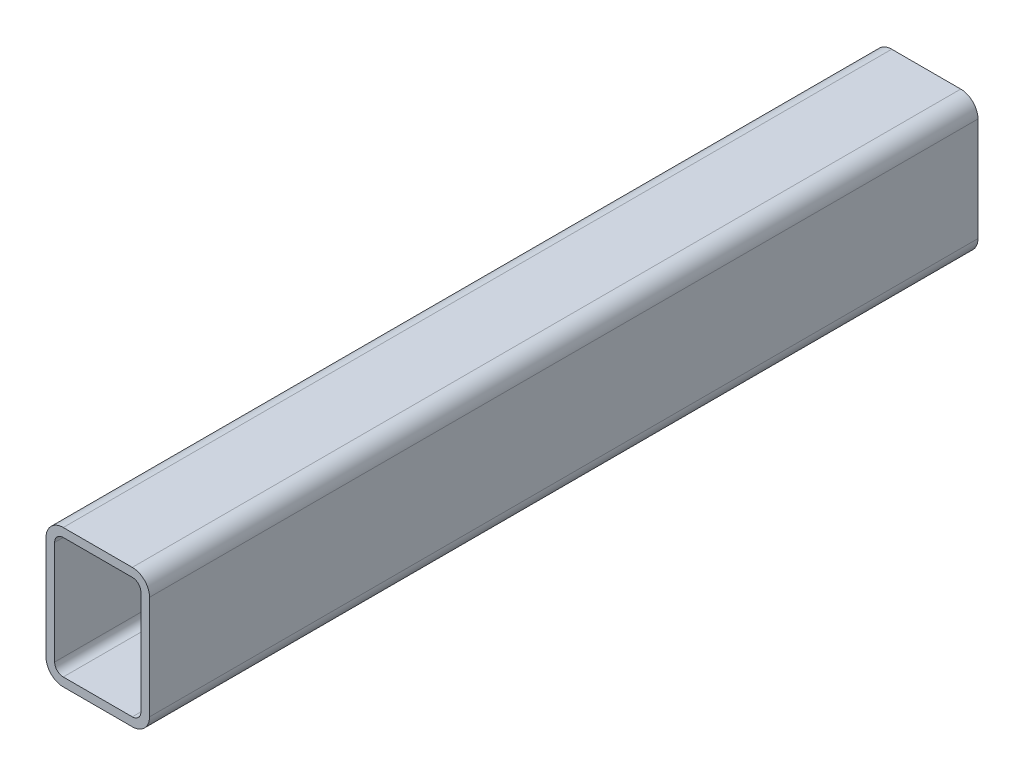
ISO-10303-21;
HEADER;
FILE_DESCRIPTION(('STEP AP214'),'2;1');
FILE_NAME('part.step','',(''),(''),'','','');
FILE_SCHEMA(('AUTOMOTIVE_DESIGN { 1 0 10303 214 1 1 1 1 }'));
ENDSEC;
DATA;
#1=APPLICATION_CONTEXT('core data for automotive mechanical design processes');
#2=APPLICATION_PROTOCOL_DEFINITION('international standard','automotive_design',2000,#1);
#3=PRODUCT_CONTEXT('',#1,'mechanical');
#4=PRODUCT('Part','Part','',(#3));
#5=PRODUCT_RELATED_PRODUCT_CATEGORY('part','',(#4));
#6=PRODUCT_DEFINITION_FORMATION('','',#4);
#7=PRODUCT_DEFINITION_CONTEXT('part definition',#1,'design');
#8=PRODUCT_DEFINITION('design','',#6,#7);
#9=PRODUCT_DEFINITION_SHAPE('','',#8);
#10=(LENGTH_UNIT() NAMED_UNIT(*) SI_UNIT(.MILLI.,.METRE.));
#11=(NAMED_UNIT(*) PLANE_ANGLE_UNIT() SI_UNIT($,.RADIAN.));
#12=(NAMED_UNIT(*) SI_UNIT($,.STERADIAN.) SOLID_ANGLE_UNIT());
#13=UNCERTAINTY_MEASURE_WITH_UNIT(LENGTH_MEASURE(1.E-05),#10,'distance_accuracy_value','');
#14=(GEOMETRIC_REPRESENTATION_CONTEXT(3) GLOBAL_UNCERTAINTY_ASSIGNED_CONTEXT((#13)) GLOBAL_UNIT_ASSIGNED_CONTEXT((#10,
#11,#12)) REPRESENTATION_CONTEXT('',''));
#15=CARTESIAN_POINT('',(0.,0.,0.));
#16=DIRECTION('',(0.,0.,1.));
#17=DIRECTION('',(1.,0.,0.));
#18=AXIS2_PLACEMENT_3D('',#15,#16,#17);
#19=CARTESIAN_POINT('',(6.35,44.45,304.8));
#20=DIRECTION('',(0.,0.,1.));
#21=DIRECTION('',(1.,0.,0.));
#22=AXIS2_PLACEMENT_3D('',#19,#20,#21);
#23=PLANE('',#22);
#24=CARTESIAN_POINT('',(6.35,44.45,304.8));
#25=DIRECTION('',(0.,0.,1.));
#26=DIRECTION('',(1.,0.,0.));
#27=AXIS2_PLACEMENT_3D('',#24,#25,#26);
#28=CIRCLE('',#27,6.35);
#29=CARTESIAN_POINT('',(6.35,50.8,304.8));
#30=VERTEX_POINT('',#29);
#31=CARTESIAN_POINT('',(0.,44.45,304.8));
#32=VERTEX_POINT('',#31);
#33=EDGE_CURVE('E211',#30,#32,#28,.T.);
#34=ORIENTED_EDGE('',*,*,#33,.T.);
#35=DIRECTION('',(0.,-1.,0.));
#36=VECTOR('',#35,1.);
#37=CARTESIAN_POINT('',(0.,6.35,304.8));
#38=LINE('',#37,#36);
#39=CARTESIAN_POINT('',(0.,6.35,304.8));
#40=VERTEX_POINT('',#39);
#41=EDGE_CURVE('E214',#32,#40,#38,.T.);
#42=ORIENTED_EDGE('',*,*,#41,.T.);
#43=CARTESIAN_POINT('',(6.35,6.35,304.8));
#44=DIRECTION('',(0.,0.,1.));
#45=DIRECTION('',(1.,0.,0.));
#46=AXIS2_PLACEMENT_3D('',#43,#44,#45);
#47=CIRCLE('',#46,6.35);
#48=CARTESIAN_POINT('',(6.35,0.,304.8));
#49=VERTEX_POINT('',#48);
#50=EDGE_CURVE('E217',#40,#49,#47,.T.);
#51=ORIENTED_EDGE('',*,*,#50,.T.);
#52=DIRECTION('',(1.,0.,0.));
#53=VECTOR('',#52,1.);
#54=CARTESIAN_POINT('',(31.75,0.,304.8));
#55=LINE('',#54,#53);
#56=CARTESIAN_POINT('',(31.75,0.,304.8));
#57=VERTEX_POINT('',#56);
#58=EDGE_CURVE('E219',#49,#57,#55,.T.);
#59=ORIENTED_EDGE('',*,*,#58,.T.);
#60=CARTESIAN_POINT('',(31.75,6.35,304.8));
#61=DIRECTION('',(0.,0.,1.));
#62=DIRECTION('',(1.,0.,0.));
#63=AXIS2_PLACEMENT_3D('',#60,#61,#62);
#64=CIRCLE('',#63,6.35);
#65=CARTESIAN_POINT('',(38.1,6.35,304.8));
#66=VERTEX_POINT('',#65);
#67=EDGE_CURVE('E221',#57,#66,#64,.T.);
#68=ORIENTED_EDGE('',*,*,#67,.T.);
#69=DIRECTION('',(0.,1.,0.));
#70=VECTOR('',#69,1.);
#71=CARTESIAN_POINT('',(38.1,44.45,304.8));
#72=LINE('',#71,#70);
#73=CARTESIAN_POINT('',(38.1,44.45,304.8));
#74=VERTEX_POINT('',#73);
#75=EDGE_CURVE('E223',#66,#74,#72,.T.);
#76=ORIENTED_EDGE('',*,*,#75,.T.);
#77=CARTESIAN_POINT('',(31.75,44.45,304.8));
#78=DIRECTION('',(0.,0.,1.));
#79=DIRECTION('',(1.,0.,0.));
#80=AXIS2_PLACEMENT_3D('',#77,#78,#79);
#81=CIRCLE('',#80,6.35000000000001);
#82=CARTESIAN_POINT('',(31.75,50.8,304.8));
#83=VERTEX_POINT('',#82);
#84=EDGE_CURVE('E225',#74,#83,#81,.T.);
#85=ORIENTED_EDGE('',*,*,#84,.T.);
#86=DIRECTION('',(-1.,0.,0.));
#87=VECTOR('',#86,1.);
#88=CARTESIAN_POINT('',(6.35,50.8,304.8));
#89=LINE('',#88,#87);
#90=EDGE_CURVE('E227',#83,#30,#89,.T.);
#91=ORIENTED_EDGE('',*,*,#90,.T.);
#92=EDGE_LOOP('',(#34,#42,#51,#59,#68,#76,#85,#91));
#93=FACE_BOUND('',#92,.T.);
#94=DIRECTION('',(0.,-1.,0.));
#95=VECTOR('',#94,1.);
#96=CARTESIAN_POINT('',(3.175,6.35,304.8));
#97=LINE('',#96,#95);
#98=CARTESIAN_POINT('',(3.175,44.45,304.8));
#99=VERTEX_POINT('',#98);
#100=CARTESIAN_POINT('',(3.175,6.35,304.8));
#101=VERTEX_POINT('',#100);
#102=EDGE_CURVE('E154',#99,#101,#97,.T.);
#103=ORIENTED_EDGE('',*,*,#102,.F.);
#104=CARTESIAN_POINT('',(6.35,44.45,304.8));
#105=DIRECTION('',(0.,0.,1.));
#106=DIRECTION('',(1.,0.,0.));
#107=AXIS2_PLACEMENT_3D('',#104,#105,#106);
#108=CIRCLE('',#107,3.175);
#109=CARTESIAN_POINT('',(6.35,47.625,304.8));
#110=VERTEX_POINT('',#109);
#111=EDGE_CURVE('E146',#110,#99,#108,.T.);
#112=ORIENTED_EDGE('',*,*,#111,.F.);
#113=DIRECTION('',(-1.,0.,0.));
#114=VECTOR('',#113,1.);
#115=CARTESIAN_POINT('',(6.35,47.625,304.8));
#116=LINE('',#115,#114);
#117=CARTESIAN_POINT('',(31.75,47.625,304.8));
#118=VERTEX_POINT('',#117);
#119=EDGE_CURVE('E179',#118,#110,#116,.T.);
#120=ORIENTED_EDGE('',*,*,#119,.F.);
#121=CARTESIAN_POINT('',(31.75,44.45,304.8));
#122=DIRECTION('',(0.,0.,1.));
#123=DIRECTION('',(1.,0.,0.));
#124=AXIS2_PLACEMENT_3D('',#121,#122,#123);
#125=CIRCLE('',#124,3.175);
#126=CARTESIAN_POINT('',(34.925,44.45,304.8));
#127=VERTEX_POINT('',#126);
#128=EDGE_CURVE('E177',#127,#118,#125,.T.);
#129=ORIENTED_EDGE('',*,*,#128,.F.);
#130=DIRECTION('',(0.,1.,0.));
#131=VECTOR('',#130,1.);
#132=CARTESIAN_POINT('',(34.925,44.45,304.8));
#133=LINE('',#132,#131);
#134=CARTESIAN_POINT('',(34.925,6.35,304.8));
#135=VERTEX_POINT('',#134);
#136=EDGE_CURVE('E175',#135,#127,#133,.T.);
#137=ORIENTED_EDGE('',*,*,#136,.F.);
#138=CARTESIAN_POINT('',(31.75,6.35,304.8));
#139=DIRECTION('',(0.,0.,1.));
#140=DIRECTION('',(1.,0.,0.));
#141=AXIS2_PLACEMENT_3D('',#138,#139,#140);
#142=CIRCLE('',#141,3.175);
#143=CARTESIAN_POINT('',(31.75,3.175,304.8));
#144=VERTEX_POINT('',#143);
#145=EDGE_CURVE('E173',#144,#135,#142,.T.);
#146=ORIENTED_EDGE('',*,*,#145,.F.);
#147=DIRECTION('',(1.,0.,0.));
#148=VECTOR('',#147,1.);
#149=CARTESIAN_POINT('',(31.75,3.175,304.8));
#150=LINE('',#149,#148);
#151=CARTESIAN_POINT('',(6.35,3.175,304.8));
#152=VERTEX_POINT('',#151);
#153=EDGE_CURVE('E169',#152,#144,#150,.T.);
#154=ORIENTED_EDGE('',*,*,#153,.F.);
#155=CARTESIAN_POINT('',(6.35,6.35,304.8));
#156=DIRECTION('',(0.,0.,1.));
#157=DIRECTION('',(1.,0.,0.));
#158=AXIS2_PLACEMENT_3D('',#155,#156,#157);
#159=CIRCLE('',#158,3.175);
#160=EDGE_CURVE('E167',#101,#152,#159,.T.);
#161=ORIENTED_EDGE('',*,*,#160,.F.);
#162=EDGE_LOOP('',(#103,#112,#120,#129,#137,#146,#154,#161));
#163=FACE_BOUND('',#162,.T.);
#164=ADVANCED_FACE('F33',(#93,#163),#23,.T.);
#165=CARTESIAN_POINT('',(6.35,44.45,0.));
#166=DIRECTION('',(0.,0.,1.));
#167=DIRECTION('',(1.,0.,0.));
#168=AXIS2_PLACEMENT_3D('',#165,#166,#167);
#169=PLANE('',#168);
#170=CARTESIAN_POINT('',(6.35,44.45,0.));
#171=DIRECTION('',(0.,0.,1.));
#172=DIRECTION('',(1.,0.,0.));
#173=AXIS2_PLACEMENT_3D('',#170,#171,#172);
#174=CIRCLE('',#173,6.35);
#175=CARTESIAN_POINT('',(6.35,50.8,0.));
#176=VERTEX_POINT('',#175);
#177=CARTESIAN_POINT('',(0.,44.45,0.));
#178=VERTEX_POINT('',#177);
#179=EDGE_CURVE('E162',#176,#178,#174,.T.);
#180=ORIENTED_EDGE('',*,*,#179,.F.);
#181=DIRECTION('',(-1.,0.,0.));
#182=VECTOR('',#181,1.);
#183=CARTESIAN_POINT('',(6.35,50.8,0.));
#184=LINE('',#183,#182);
#185=CARTESIAN_POINT('',(31.75,50.8,0.));
#186=VERTEX_POINT('',#185);
#187=EDGE_CURVE('E215',#186,#176,#184,.T.);
#188=ORIENTED_EDGE('',*,*,#187,.F.);
#189=CARTESIAN_POINT('',(31.75,44.45,0.));
#190=DIRECTION('',(0.,0.,1.));
#191=DIRECTION('',(1.,0.,0.));
#192=AXIS2_PLACEMENT_3D('',#189,#190,#191);
#193=CIRCLE('',#192,6.35000000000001);
#194=CARTESIAN_POINT('',(38.1,44.45,0.));
#195=VERTEX_POINT('',#194);
#196=EDGE_CURVE('E242',#195,#186,#193,.T.);
#197=ORIENTED_EDGE('',*,*,#196,.F.);
#198=DIRECTION('',(0.,1.,0.));
#199=VECTOR('',#198,1.);
#200=CARTESIAN_POINT('',(38.1,44.45,0.));
#201=LINE('',#200,#199);
#202=CARTESIAN_POINT('',(38.1,6.35,0.));
#203=VERTEX_POINT('',#202);
#204=EDGE_CURVE('E240',#203,#195,#201,.T.);
#205=ORIENTED_EDGE('',*,*,#204,.F.);
#206=CARTESIAN_POINT('',(31.75,6.35,0.));
#207=DIRECTION('',(0.,0.,1.));
#208=DIRECTION('',(1.,0.,0.));
#209=AXIS2_PLACEMENT_3D('',#206,#207,#208);
#210=CIRCLE('',#209,6.35);
#211=CARTESIAN_POINT('',(31.75,0.,0.));
#212=VERTEX_POINT('',#211);
#213=EDGE_CURVE('E238',#212,#203,#210,.T.);
#214=ORIENTED_EDGE('',*,*,#213,.F.);
#215=DIRECTION('',(1.,0.,0.));
#216=VECTOR('',#215,1.);
#217=CARTESIAN_POINT('',(31.75,0.,0.));
#218=LINE('',#217,#216);
#219=CARTESIAN_POINT('',(6.35,0.,0.));
#220=VERTEX_POINT('',#219);
#221=EDGE_CURVE('E236',#220,#212,#218,.T.);
#222=ORIENTED_EDGE('',*,*,#221,.F.);
#223=CARTESIAN_POINT('',(6.35,6.35,0.));
#224=DIRECTION('',(0.,0.,1.));
#225=DIRECTION('',(1.,0.,0.));
#226=AXIS2_PLACEMENT_3D('',#223,#224,#225);
#227=CIRCLE('',#226,6.35);
#228=CARTESIAN_POINT('',(0.,6.35,0.));
#229=VERTEX_POINT('',#228);
#230=EDGE_CURVE('E234',#229,#220,#227,.T.);
#231=ORIENTED_EDGE('',*,*,#230,.F.);
#232=DIRECTION('',(0.,-1.,0.));
#233=VECTOR('',#232,1.);
#234=CARTESIAN_POINT('',(0.,6.35,0.));
#235=LINE('',#234,#233);
#236=EDGE_CURVE('E232',#178,#229,#235,.T.);
#237=ORIENTED_EDGE('',*,*,#236,.F.);
#238=EDGE_LOOP('',(#180,#188,#197,#205,#214,#222,#231,#237));
#239=FACE_BOUND('',#238,.T.);
#240=CARTESIAN_POINT('',(6.35,44.45,0.));
#241=DIRECTION('',(0.,0.,1.));
#242=DIRECTION('',(1.,0.,0.));
#243=AXIS2_PLACEMENT_3D('',#240,#241,#242);
#244=CIRCLE('',#243,3.175);
#245=CARTESIAN_POINT('',(6.35,47.625,0.));
#246=VERTEX_POINT('',#245);
#247=CARTESIAN_POINT('',(3.175,44.45,0.));
#248=VERTEX_POINT('',#247);
#249=EDGE_CURVE('E56',#246,#248,#244,.T.);
#250=ORIENTED_EDGE('',*,*,#249,.T.);
#251=DIRECTION('',(0.,-1.,0.));
#252=VECTOR('',#251,1.);
#253=CARTESIAN_POINT('',(3.175,6.35,0.));
#254=LINE('',#253,#252);
#255=CARTESIAN_POINT('',(3.175,6.35,0.));
#256=VERTEX_POINT('',#255);
#257=EDGE_CURVE('E161',#248,#256,#254,.T.);
#258=ORIENTED_EDGE('',*,*,#257,.T.);
#259=CARTESIAN_POINT('',(6.35,6.35,0.));
#260=DIRECTION('',(0.,0.,1.));
#261=DIRECTION('',(1.,0.,0.));
#262=AXIS2_PLACEMENT_3D('',#259,#260,#261);
#263=CIRCLE('',#262,3.175);
#264=CARTESIAN_POINT('',(6.35,3.175,0.));
#265=VERTEX_POINT('',#264);
#266=EDGE_CURVE('E183',#256,#265,#263,.T.);
#267=ORIENTED_EDGE('',*,*,#266,.T.);
#268=DIRECTION('',(1.,0.,0.));
#269=VECTOR('',#268,1.);
#270=CARTESIAN_POINT('',(31.75,3.175,0.));
#271=LINE('',#270,#269);
#272=CARTESIAN_POINT('',(31.75,3.175,0.));
#273=VERTEX_POINT('',#272);
#274=EDGE_CURVE('E186',#265,#273,#271,.T.);
#275=ORIENTED_EDGE('',*,*,#274,.T.);
#276=CARTESIAN_POINT('',(31.75,6.35,0.));
#277=DIRECTION('',(0.,0.,1.));
#278=DIRECTION('',(1.,0.,0.));
#279=AXIS2_PLACEMENT_3D('',#276,#277,#278);
#280=CIRCLE('',#279,3.175);
#281=CARTESIAN_POINT('',(34.925,6.35,0.));
#282=VERTEX_POINT('',#281);
#283=EDGE_CURVE('E189',#273,#282,#280,.T.);
#284=ORIENTED_EDGE('',*,*,#283,.T.);
#285=DIRECTION('',(0.,1.,0.));
#286=VECTOR('',#285,1.);
#287=CARTESIAN_POINT('',(34.925,44.45,0.));
#288=LINE('',#287,#286);
#289=CARTESIAN_POINT('',(34.925,44.45,0.));
#290=VERTEX_POINT('',#289);
#291=EDGE_CURVE('E192',#282,#290,#288,.T.);
#292=ORIENTED_EDGE('',*,*,#291,.T.);
#293=CARTESIAN_POINT('',(31.75,44.45,0.));
#294=DIRECTION('',(0.,0.,1.));
#295=DIRECTION('',(1.,0.,0.));
#296=AXIS2_PLACEMENT_3D('',#293,#294,#295);
#297=CIRCLE('',#296,3.175);
#298=CARTESIAN_POINT('',(31.75,47.625,0.));
#299=VERTEX_POINT('',#298);
#300=EDGE_CURVE('E195',#290,#299,#297,.T.);
#301=ORIENTED_EDGE('',*,*,#300,.T.);
#302=DIRECTION('',(-1.,0.,0.));
#303=VECTOR('',#302,1.);
#304=CARTESIAN_POINT('',(6.35,47.625,0.));
#305=LINE('',#304,#303);
#306=EDGE_CURVE('E155',#299,#246,#305,.T.);
#307=ORIENTED_EDGE('',*,*,#306,.T.);
#308=EDGE_LOOP('',(#250,#258,#267,#275,#284,#292,#301,#307));
#309=FACE_BOUND('',#308,.T.);
#310=ADVANCED_FACE('F272',(#239,#309),#169,.F.);
#311=CARTESIAN_POINT('',(6.35,44.45,304.8));
#312=DIRECTION('',(0.,0.,-1.));
#313=DIRECTION('',(-1.,0.,0.));
#314=AXIS2_PLACEMENT_3D('',#311,#312,#313);
#315=CYLINDRICAL_SURFACE('',#314,6.35);
#316=ORIENTED_EDGE('',*,*,#179,.T.);
#317=DIRECTION('',(0.,0.,-1.));
#318=VECTOR('',#317,1.);
#319=CARTESIAN_POINT('',(0.,44.45,304.8));
#320=LINE('',#319,#318);
#321=EDGE_CURVE('E11',#32,#178,#320,.T.);
#322=ORIENTED_EDGE('',*,*,#321,.F.);
#323=ORIENTED_EDGE('',*,*,#33,.F.);
#324=DIRECTION('',(0.,0.,-1.));
#325=VECTOR('',#324,1.);
#326=CARTESIAN_POINT('',(6.35,50.8,304.8));
#327=LINE('',#326,#325);
#328=EDGE_CURVE('E229',#30,#176,#327,.T.);
#329=ORIENTED_EDGE('',*,*,#328,.T.);
#330=EDGE_LOOP('',(#316,#322,#323,#329));
#331=FACE_BOUND('',#330,.T.);
#332=ADVANCED_FACE('F35',(#331),#315,.T.);
#333=CARTESIAN_POINT('',(0.,6.35,304.8));
#334=DIRECTION('',(1.,0.,0.));
#335=DIRECTION('',(0.,0.,-1.));
#336=AXIS2_PLACEMENT_3D('',#333,#334,#335);
#337=PLANE('',#336);
#338=ORIENTED_EDGE('',*,*,#236,.T.);
#339=DIRECTION('',(0.,0.,-1.));
#340=VECTOR('',#339,1.);
#341=CARTESIAN_POINT('',(0.,6.35,304.8));
#342=LINE('',#341,#340);
#343=EDGE_CURVE('E41',#40,#229,#342,.T.);
#344=ORIENTED_EDGE('',*,*,#343,.F.);
#345=ORIENTED_EDGE('',*,*,#41,.F.);
#346=ORIENTED_EDGE('',*,*,#321,.T.);
#347=EDGE_LOOP('',(#338,#344,#345,#346));
#348=FACE_BOUND('',#347,.T.);
#349=ADVANCED_FACE('F289',(#348),#337,.F.);
#350=CARTESIAN_POINT('',(6.35,6.35,304.8));
#351=DIRECTION('',(0.,0.,-1.));
#352=DIRECTION('',(-1.,0.,0.));
#353=AXIS2_PLACEMENT_3D('',#350,#351,#352);
#354=CYLINDRICAL_SURFACE('',#353,6.35);
#355=ORIENTED_EDGE('',*,*,#230,.T.);
#356=DIRECTION('',(0.,0.,-1.));
#357=VECTOR('',#356,1.);
#358=CARTESIAN_POINT('',(6.35,0.,304.8));
#359=LINE('',#358,#357);
#360=EDGE_CURVE('E259',#49,#220,#359,.T.);
#361=ORIENTED_EDGE('',*,*,#360,.F.);
#362=ORIENTED_EDGE('',*,*,#50,.F.);
#363=ORIENTED_EDGE('',*,*,#343,.T.);
#364=EDGE_LOOP('',(#355,#361,#362,#363));
#365=FACE_BOUND('',#364,.T.);
#366=ADVANCED_FACE('F266',(#365),#354,.T.);
#367=CARTESIAN_POINT('',(31.75,0.,304.8));
#368=DIRECTION('',(0.,1.,0.));
#369=DIRECTION('',(0.,0.,1.));
#370=AXIS2_PLACEMENT_3D('',#367,#368,#369);
#371=PLANE('',#370);
#372=ORIENTED_EDGE('',*,*,#221,.T.);
#373=DIRECTION('',(0.,0.,-1.));
#374=VECTOR('',#373,1.);
#375=CARTESIAN_POINT('',(31.75,0.,304.8));
#376=LINE('',#375,#374);
#377=EDGE_CURVE('E256',#57,#212,#376,.T.);
#378=ORIENTED_EDGE('',*,*,#377,.F.);
#379=ORIENTED_EDGE('',*,*,#58,.F.);
#380=ORIENTED_EDGE('',*,*,#360,.T.);
#381=EDGE_LOOP('',(#372,#378,#379,#380));
#382=FACE_BOUND('',#381,.T.);
#383=ADVANCED_FACE('F278',(#382),#371,.F.);
#384=CARTESIAN_POINT('',(31.75,6.35,304.8));
#385=DIRECTION('',(0.,0.,-1.));
#386=DIRECTION('',(-1.,0.,0.));
#387=AXIS2_PLACEMENT_3D('',#384,#385,#386);
#388=CYLINDRICAL_SURFACE('',#387,6.35);
#389=ORIENTED_EDGE('',*,*,#213,.T.);
#390=DIRECTION('',(0.,0.,-1.));
#391=VECTOR('',#390,1.);
#392=CARTESIAN_POINT('',(38.1,6.35,304.8));
#393=LINE('',#392,#391);
#394=EDGE_CURVE('E253',#66,#203,#393,.T.);
#395=ORIENTED_EDGE('',*,*,#394,.F.);
#396=ORIENTED_EDGE('',*,*,#67,.F.);
#397=ORIENTED_EDGE('',*,*,#377,.T.);
#398=EDGE_LOOP('',(#389,#395,#396,#397));
#399=FACE_BOUND('',#398,.T.);
#400=ADVANCED_FACE('F282',(#399),#388,.T.);
#401=CARTESIAN_POINT('',(38.1,44.45,304.8));
#402=DIRECTION('',(-1.,0.,0.));
#403=DIRECTION('',(0.,0.,1.));
#404=AXIS2_PLACEMENT_3D('',#401,#402,#403);
#405=PLANE('',#404);
#406=ORIENTED_EDGE('',*,*,#204,.T.);
#407=DIRECTION('',(0.,0.,-1.));
#408=VECTOR('',#407,1.);
#409=CARTESIAN_POINT('',(38.1,44.45,304.8));
#410=LINE('',#409,#408);
#411=EDGE_CURVE('E250',#74,#195,#410,.T.);
#412=ORIENTED_EDGE('',*,*,#411,.F.);
#413=ORIENTED_EDGE('',*,*,#75,.F.);
#414=ORIENTED_EDGE('',*,*,#394,.T.);
#415=EDGE_LOOP('',(#406,#412,#413,#414));
#416=FACE_BOUND('',#415,.T.);
#417=ADVANCED_FACE('F302',(#416),#405,.F.);
#418=CARTESIAN_POINT('',(31.75,44.45,304.8));
#419=DIRECTION('',(0.,0.,-1.));
#420=DIRECTION('',(-1.,0.,0.));
#421=AXIS2_PLACEMENT_3D('',#418,#419,#420);
#422=CYLINDRICAL_SURFACE('',#421,6.35000000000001);
#423=ORIENTED_EDGE('',*,*,#196,.T.);
#424=DIRECTION('',(0.,0.,-1.));
#425=VECTOR('',#424,1.);
#426=CARTESIAN_POINT('',(31.75,50.8,304.8));
#427=LINE('',#426,#425);
#428=EDGE_CURVE('E247',#83,#186,#427,.T.);
#429=ORIENTED_EDGE('',*,*,#428,.F.);
#430=ORIENTED_EDGE('',*,*,#84,.F.);
#431=ORIENTED_EDGE('',*,*,#411,.T.);
#432=EDGE_LOOP('',(#423,#429,#430,#431));
#433=FACE_BOUND('',#432,.T.);
#434=ADVANCED_FACE('F300',(#433),#422,.T.);
#435=CARTESIAN_POINT('',(6.35,50.8,304.8));
#436=DIRECTION('',(0.,-1.,0.));
#437=DIRECTION('',(0.,0.,-1.));
#438=AXIS2_PLACEMENT_3D('',#435,#436,#437);
#439=PLANE('',#438);
#440=ORIENTED_EDGE('',*,*,#187,.T.);
#441=ORIENTED_EDGE('',*,*,#328,.F.);
#442=ORIENTED_EDGE('',*,*,#90,.F.);
#443=ORIENTED_EDGE('',*,*,#428,.T.);
#444=EDGE_LOOP('',(#440,#441,#442,#443));
#445=FACE_BOUND('',#444,.T.);
#446=ADVANCED_FACE('F295',(#445),#439,.F.);
#447=CARTESIAN_POINT('',(6.35,44.45,304.8));
#448=DIRECTION('',(0.,0.,-1.));
#449=DIRECTION('',(-1.,0.,0.));
#450=AXIS2_PLACEMENT_3D('',#447,#448,#449);
#451=CYLINDRICAL_SURFACE('',#450,3.175);
#452=ORIENTED_EDGE('',*,*,#249,.F.);
#453=DIRECTION('',(0.,0.,-1.));
#454=VECTOR('',#453,1.);
#455=CARTESIAN_POINT('',(6.35,47.625,304.8));
#456=LINE('',#455,#454);
#457=EDGE_CURVE('E150',#110,#246,#456,.T.);
#458=ORIENTED_EDGE('',*,*,#457,.F.);
#459=ORIENTED_EDGE('',*,*,#111,.T.);
#460=DIRECTION('',(0.,0.,-1.));
#461=VECTOR('',#460,1.);
#462=CARTESIAN_POINT('',(3.175,44.45,304.8));
#463=LINE('',#462,#461);
#464=EDGE_CURVE('E149',#99,#248,#463,.T.);
#465=ORIENTED_EDGE('',*,*,#464,.T.);
#466=EDGE_LOOP('',(#452,#458,#459,#465));
#467=FACE_BOUND('',#466,.T.);
#468=ADVANCED_FACE('F148',(#467),#451,.F.);
#469=CARTESIAN_POINT('',(3.175,6.35,304.8));
#470=DIRECTION('',(1.,0.,0.));
#471=DIRECTION('',(0.,0.,-1.));
#472=AXIS2_PLACEMENT_3D('',#469,#470,#471);
#473=PLANE('',#472);
#474=ORIENTED_EDGE('',*,*,#257,.F.);
#475=ORIENTED_EDGE('',*,*,#464,.F.);
#476=ORIENTED_EDGE('',*,*,#102,.T.);
#477=DIRECTION('',(0.,0.,-1.));
#478=VECTOR('',#477,1.);
#479=CARTESIAN_POINT('',(3.175,6.35,304.8));
#480=LINE('',#479,#478);
#481=EDGE_CURVE('E163',#101,#256,#480,.T.);
#482=ORIENTED_EDGE('',*,*,#481,.T.);
#483=EDGE_LOOP('',(#474,#475,#476,#482));
#484=FACE_BOUND('',#483,.T.);
#485=ADVANCED_FACE('F158',(#484),#473,.T.);
#486=CARTESIAN_POINT('',(6.35,6.35,304.8));
#487=DIRECTION('',(0.,0.,-1.));
#488=DIRECTION('',(-1.,0.,0.));
#489=AXIS2_PLACEMENT_3D('',#486,#487,#488);
#490=CYLINDRICAL_SURFACE('',#489,3.175);
#491=ORIENTED_EDGE('',*,*,#266,.F.);
#492=ORIENTED_EDGE('',*,*,#481,.F.);
#493=ORIENTED_EDGE('',*,*,#160,.T.);
#494=DIRECTION('',(0.,0.,-1.));
#495=VECTOR('',#494,1.);
#496=CARTESIAN_POINT('',(6.35,3.175,304.8));
#497=LINE('',#496,#495);
#498=EDGE_CURVE('E208',#152,#265,#497,.T.);
#499=ORIENTED_EDGE('',*,*,#498,.T.);
#500=EDGE_LOOP('',(#491,#492,#493,#499));
#501=FACE_BOUND('',#500,.T.);
#502=ADVANCED_FACE('F327',(#501),#490,.F.);
#503=CARTESIAN_POINT('',(31.75,3.175,304.8));
#504=DIRECTION('',(0.,1.,0.));
#505=DIRECTION('',(0.,0.,1.));
#506=AXIS2_PLACEMENT_3D('',#503,#504,#505);
#507=PLANE('',#506);
#508=ORIENTED_EDGE('',*,*,#274,.F.);
#509=ORIENTED_EDGE('',*,*,#498,.F.);
#510=ORIENTED_EDGE('',*,*,#153,.T.);
#511=DIRECTION('',(0.,0.,-1.));
#512=VECTOR('',#511,1.);
#513=CARTESIAN_POINT('',(31.75,3.175,304.8));
#514=LINE('',#513,#512);
#515=EDGE_CURVE('E206',#144,#273,#514,.T.);
#516=ORIENTED_EDGE('',*,*,#515,.T.);
#517=EDGE_LOOP('',(#508,#509,#510,#516));
#518=FACE_BOUND('',#517,.T.);
#519=ADVANCED_FACE('F331',(#518),#507,.T.);
#520=CARTESIAN_POINT('',(31.75,6.35,304.8));
#521=DIRECTION('',(0.,0.,-1.));
#522=DIRECTION('',(-1.,0.,0.));
#523=AXIS2_PLACEMENT_3D('',#520,#521,#522);
#524=CYLINDRICAL_SURFACE('',#523,3.175);
#525=ORIENTED_EDGE('',*,*,#283,.F.);
#526=ORIENTED_EDGE('',*,*,#515,.F.);
#527=ORIENTED_EDGE('',*,*,#145,.T.);
#528=DIRECTION('',(0.,0.,-1.));
#529=VECTOR('',#528,1.);
#530=CARTESIAN_POINT('',(34.925,6.35,304.8));
#531=LINE('',#530,#529);
#532=EDGE_CURVE('E204',#135,#282,#531,.T.);
#533=ORIENTED_EDGE('',*,*,#532,.T.);
#534=EDGE_LOOP('',(#525,#526,#527,#533));
#535=FACE_BOUND('',#534,.T.);
#536=ADVANCED_FACE('F337',(#535),#524,.F.);
#537=CARTESIAN_POINT('',(34.925,44.45,304.8));
#538=DIRECTION('',(-1.,0.,0.));
#539=DIRECTION('',(0.,0.,1.));
#540=AXIS2_PLACEMENT_3D('',#537,#538,#539);
#541=PLANE('',#540);
#542=ORIENTED_EDGE('',*,*,#291,.F.);
#543=ORIENTED_EDGE('',*,*,#532,.F.);
#544=ORIENTED_EDGE('',*,*,#136,.T.);
#545=DIRECTION('',(0.,0.,-1.));
#546=VECTOR('',#545,1.);
#547=CARTESIAN_POINT('',(34.925,44.45,304.8));
#548=LINE('',#547,#546);
#549=EDGE_CURVE('E202',#127,#290,#548,.T.);
#550=ORIENTED_EDGE('',*,*,#549,.T.);
#551=EDGE_LOOP('',(#542,#543,#544,#550));
#552=FACE_BOUND('',#551,.T.);
#553=ADVANCED_FACE('F341',(#552),#541,.T.);
#554=CARTESIAN_POINT('',(31.75,44.45,304.8));
#555=DIRECTION('',(0.,0.,-1.));
#556=DIRECTION('',(-1.,0.,0.));
#557=AXIS2_PLACEMENT_3D('',#554,#555,#556);
#558=CYLINDRICAL_SURFACE('',#557,3.175);
#559=ORIENTED_EDGE('',*,*,#300,.F.);
#560=ORIENTED_EDGE('',*,*,#549,.F.);
#561=ORIENTED_EDGE('',*,*,#128,.T.);
#562=DIRECTION('',(0.,0.,-1.));
#563=VECTOR('',#562,1.);
#564=CARTESIAN_POINT('',(31.75,47.625,304.8));
#565=LINE('',#564,#563);
#566=EDGE_CURVE('E48',#118,#299,#565,.T.);
#567=ORIENTED_EDGE('',*,*,#566,.T.);
#568=EDGE_LOOP('',(#559,#560,#561,#567));
#569=FACE_BOUND('',#568,.T.);
#570=ADVANCED_FACE('F345',(#569),#558,.F.);
#571=CARTESIAN_POINT('',(6.35,47.625,304.8));
#572=DIRECTION('',(0.,-1.,0.));
#573=DIRECTION('',(0.,0.,-1.));
#574=AXIS2_PLACEMENT_3D('',#571,#572,#573);
#575=PLANE('',#574);
#576=ORIENTED_EDGE('',*,*,#306,.F.);
#577=ORIENTED_EDGE('',*,*,#566,.F.);
#578=ORIENTED_EDGE('',*,*,#119,.T.);
#579=ORIENTED_EDGE('',*,*,#457,.T.);
#580=EDGE_LOOP('',(#576,#577,#578,#579));
#581=FACE_BOUND('',#580,.T.);
#582=ADVANCED_FACE('F349',(#581),#575,.T.);
#583=CLOSED_SHELL('',(#164,#310,#332,#349,#366,#383,#400,#417,#434,#446,#468,#485,#502,#519,
#536,#553,#570,#582));
#584=MANIFOLD_SOLID_BREP('B2',#583);
#585=ADVANCED_BREP_SHAPE_REPRESENTATION('',(#18,#584),#14);
#586=SHAPE_DEFINITION_REPRESENTATION(#9,#585);
ENDSEC;
END-ISO-10303-21;
